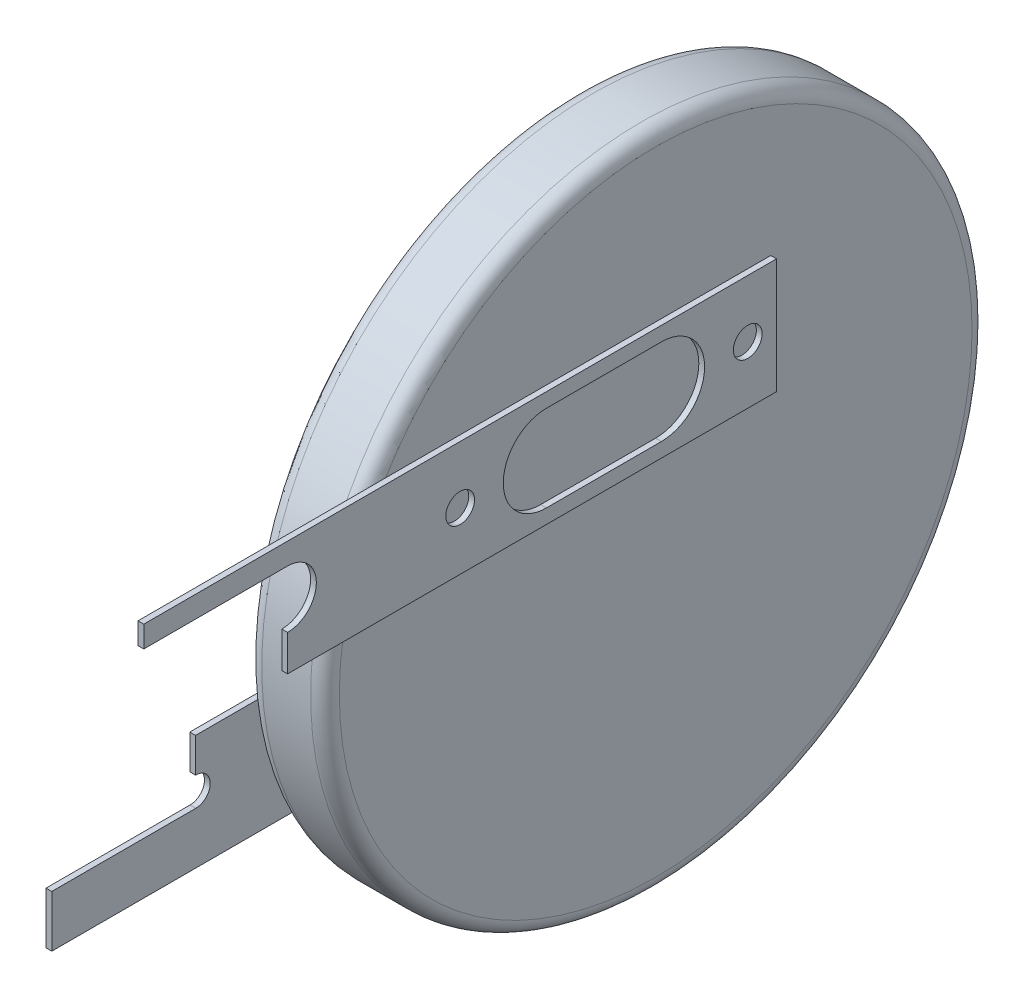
from build123d import *

# Parameters (mm, degrees)
SKETCH2_R           = 0.5
BOSS_EXTRUDE1_DEPTH = 0.2
SKETCH3_R           = 0.5
BOSS_EXTRUDE2_DEPTH = 0.2


with BuildPart() as part:
    # Sketch1 → Revolve1 (revolve)
    with BuildSketch(Plane.XY, mode=Mode.PRIVATE) as revolve1_sk:
        with BuildLine():
            Line((0, 0), (0, 11))
            ThreePointArc((0, 11), (-0.146446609, 11.353553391), (-0.5, 11.5))
            Line((-0.5, 11.5), (-2.2, 11.5))
            ThreePointArc((-2.2, 11.5), (-2.553553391, 11.353553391), (-2.7, 11))
            Line((-2.7, 11), (-2.7, 9.5))
            Line((-2.7, 9.5), (-2.75, 9.5))
            ThreePointArc((-2.75, 9.5), (-2.926776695, 9.426776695), (-3, 9.25))
            Line((-3, 9.25), (-3, 0))
            Line((-3, 0), (0, 0))
        make_face()
    revolve(revolve1_sk.sketch.rotate(Axis((0, 0, 0), (-1, 0, 0)), 90), axis=Axis((0, 0, 0), (-1, 0, 0)))

    # Sketch2 → Boss-Extrude1 (add)
    with BuildSketch(Plane.ZY.offset(3)):
        with BuildLine():
            Line((-4, -1.725), (13, -1.725))
            Line((13, -1.725), (13, -2.925))
            Line((13, -2.925), (12.99, -2.925))
            ThreePointArc((12.99, -2.925), (12.49, -3.425), (12.99, -3.925))
            Line((12.99, -3.925), (18, -3.925))
            Line((18, -3.925), (18, -5.725))
            Line((18, -5.725), (-4, -5.725))
            Line((-4, -5.725), (-4, -1.725))
        make_face()
        with Locations((-3, -3.725)):
            Circle(SKETCH2_R, mode=Mode.SUBTRACT)
        with Locations((7, -3.725)):
            Circle(SKETCH2_R, mode=Mode.SUBTRACT)
        with BuildLine():
            Line((0, -2.225), (4, -2.225))
            ThreePointArc((4, -2.225), (5.5, -3.725), (4, -5.225))
            Line((4, -5.225), (0, -5.225))
            ThreePointArc((0, -5.225), (-1.5, -3.725), (0, -2.225))
        make_face(mode=Mode.SUBTRACT)
    extrude(amount=BOSS_EXTRUDE1_DEPTH)

    # Sketch3 → Boss-Extrude2 (add)
    with BuildSketch(Plane(origin=(0, 0, 0), x_dir=(0, 0, -1), z_dir=(1, 0, 0))):
        with BuildLine():
            Line((-18, 5.725), (4, 5.725))
            Line((4, 5.725), (4, 1.725))
            Line((4, 1.725), (-13, 1.725))
            Line((-13, 1.725), (-13, 2.975))
            ThreePointArc((-13, 2.975), (-12, 3.975), (-13, 4.975))
            Line((-13, 4.975), (-18, 4.975))
            Line((-18, 4.975), (-18, 5.725))
        make_face()
        with Locations((3, 3.725)):
            Circle(SKETCH3_R, mode=Mode.SUBTRACT)
        with Locations((-7, 3.725)):
            Circle(SKETCH3_R, mode=Mode.SUBTRACT)
        with BuildLine():
            Line((-4, 5.225), (0, 5.225))
            ThreePointArc((0, 5.225), (1.5, 3.725), (0, 2.225))
            Line((0, 2.225), (-4, 2.225))
            ThreePointArc((-4, 2.225), (-5.5, 3.725), (-4, 5.225))
        make_face(mode=Mode.SUBTRACT)
    extrude(amount=BOSS_EXTRUDE2_DEPTH)


solid = part.part
